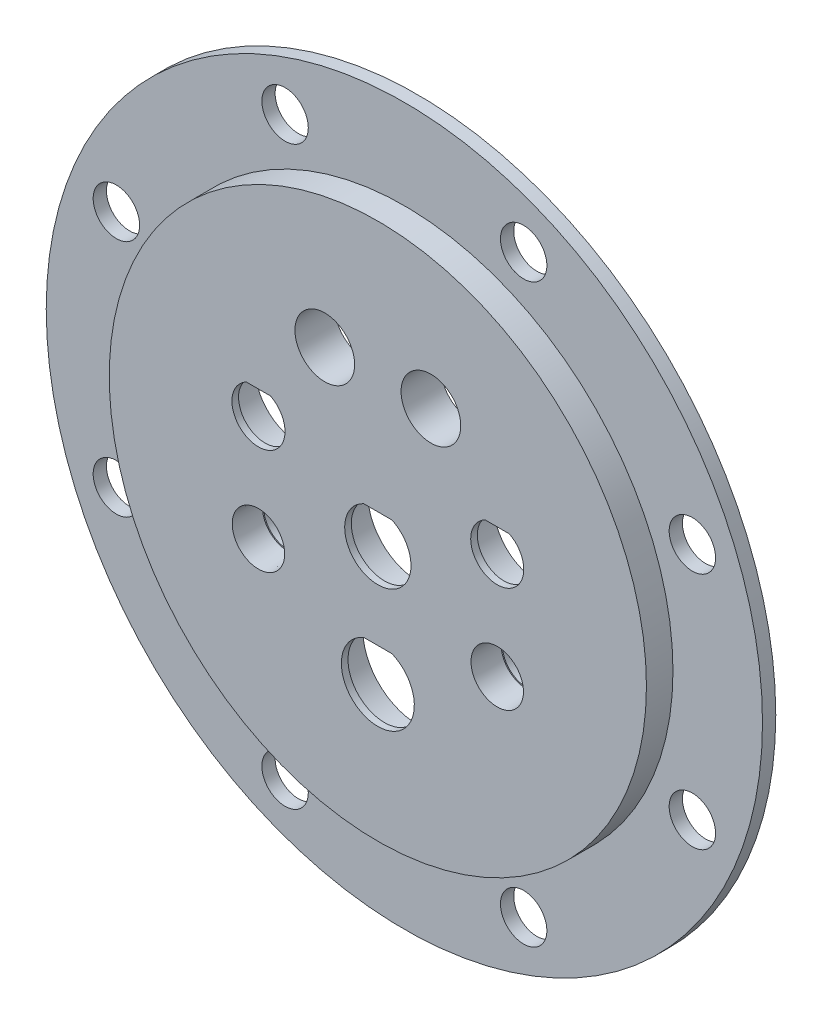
from build123d import *

# Parameters (mm, degrees)
SKETCH1_R                         = 171.45
BOSS_EXTRUDE1_DEPTH               = 19.05
CUT_EXTRUDE1_START                = -12.7
SKETCH2_R                         = 171.45
SKETCH2_R_2                       = 128.5875
CUT_EXTRUDE1_DEPTH                = 12.7
F_7_8_0_875_DIAMETER_HOLE1_D      = 22.225
CIRPATTERN1_COUNT                 = 8
F_3_4_NPT_TAPPED_HOLE1_AT_2_COUNT = 2
F_3_4_NPT_TAPPED_HOLE1_AT_2_PITCH = 114.3
SKETCH7_R                         = 14.2875
CUT_EXTRUDE2_DEPTH                = 244.214118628
CUT_EXTRUDE3_DEPTH                = 244.214118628
SKETCH9_R                         = 20.6375
SKETCH9_R_2                       = 23.8125
SKETCH9_R_3                       = 26.2509
CUT_EXTRUDE4_DEPTH                = 15.875


with BuildPart() as part:
    # Sketch1 → Boss-Extrude1 (new body)
    with BuildSketch(Plane.XY):
        with Locations(Location((0, 0, 0), (0, 0, 180))):
            Circle(SKETCH1_R)
    extrude(amount=BOSS_EXTRUDE1_DEPTH)

    # Sketch2 → Cut-Extrude1 (cut)
    with BuildSketch(Plane.XY.offset(19.05).offset(CUT_EXTRUDE1_START)):
        with Locations(Location((0, 0, 0), (0, 0, 180))):
            Circle(SKETCH2_R)
        Circle(SKETCH2_R_2, mode=Mode.SUBTRACT)
    extrude(amount=CUT_EXTRUDE1_DEPTH, mode=Mode.SUBTRACT)

    # 7_8 _0.875_ Diameter Hole1 (through all)
    with Locations(Plane.XY.offset(6.35)):
        with Locations((-57.105935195, 137.865923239)):
            f_7_8_0_875_diameter_hole1 = Hole(F_7_8_0_875_DIAMETER_HOLE1_D / 2)

    # CirPattern1: 7_8 _0.875_ Diameter Hole1 ×8 about axis
    cirpattern1_axis = Axis((0, 0, 0), (0, 0, 1))
    for i in range(1, CIRPATTERN1_COUNT):
        add(f_7_8_0_875_diameter_hole1.rotate(cirpattern1_axis, i * 360 / CIRPATTERN1_COUNT), mode=Mode.SUBTRACT)

    # Sketch5 → 3_4 NPT Tapped Hole1 (revolve, cut)
    with BuildSketch(Plane(origin=(-57.15, -31.75, 19.05), x_dir=(0, -1, 0), z_dir=(1, 0, 0))):
        Polygon((0, 0), (0, 19.05), (11.5062, 19.05), (11.5062, 14.0462), (12.137858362, 14.0462), (12.5584204, 0), align=None)
    f_3_4_npt_tapped_hole1 = revolve(axis=Axis((-57.15, -31.75, 25.4), (0, 0, -1)), mode=Mode.SUBTRACT)

    # 3_4 NPT Tapped Hole1 at 2: 3_4 NPT Tapped Hole1 ×2
    with Locations(*[(i * F_3_4_NPT_TAPPED_HOLE1_AT_2_PITCH, 0, 0) for i in range(1, F_3_4_NPT_TAPPED_HOLE1_AT_2_COUNT)]):
        add(f_3_4_npt_tapped_hole1, mode=Mode.SUBTRACT)

    # Sketch7 → Cut-Extrude2 (cut, through all)
    with BuildSketch(Plane.XY.offset(19.05)):
        with Locations((-25.4, 63.5)):
            Circle(SKETCH7_R)
        with Locations((25.4, 63.5)):
            Circle(SKETCH7_R)
    extrude(amount=-CUT_EXTRUDE2_DEPTH, mode=Mode.SUBTRACT)

    # Sketch8 → Cut-Extrude3 (cut, through all)
    with BuildSketch(Plane.XY.offset(19.05)):
        with BuildLine():
            Line((-62.940698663, 30.353), (-51.359301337, 30.353))
            ThreePointArc((-51.359301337, 30.353), (-57.15, 6.35), (-62.940698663, 30.353))
        make_face()
        with BuildLine():
            Line((51.359301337, 30.353), (62.940698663, 30.353))
            ThreePointArc((62.940698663, 30.353), (57.15, 6.35), (51.359301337, 30.353))
        make_face()
        with BuildLine():
            Line((6.787077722, 8.001), (-6.787077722, 8.001))
            ThreePointArc((-6.787077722, 8.001), (0, -22.225), (6.787077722, 8.001))
        make_face()
        with BuildLine():
            Line((-6.813984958, -47.4218), (6.813984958, -47.4218))
            ThreePointArc((6.813984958, -47.4218), (0, -80.9625), (-6.813984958, -47.4218))
        make_face()
    extrude(amount=-CUT_EXTRUDE3_DEPTH, mode=Mode.SUBTRACT)

    # Sketch9 → Cut-Extrude4 (cut)
    with BuildSketch(Plane(origin=(0, 0, 0), x_dir=(-1, 0, 0), z_dir=(0, 0, -1))):
        with Locations((-57.15, 19.05)):
            Circle(SKETCH9_R)
        with Locations((57.15, 19.05)):
            Circle(SKETCH9_R)
        with Locations((0, -6.35)):
            Circle(SKETCH9_R_2)
        with Locations((0, -63.5)):
            Circle(SKETCH9_R_3)
    extrude(amount=-CUT_EXTRUDE4_DEPTH, mode=Mode.SUBTRACT)


solid = part.part
